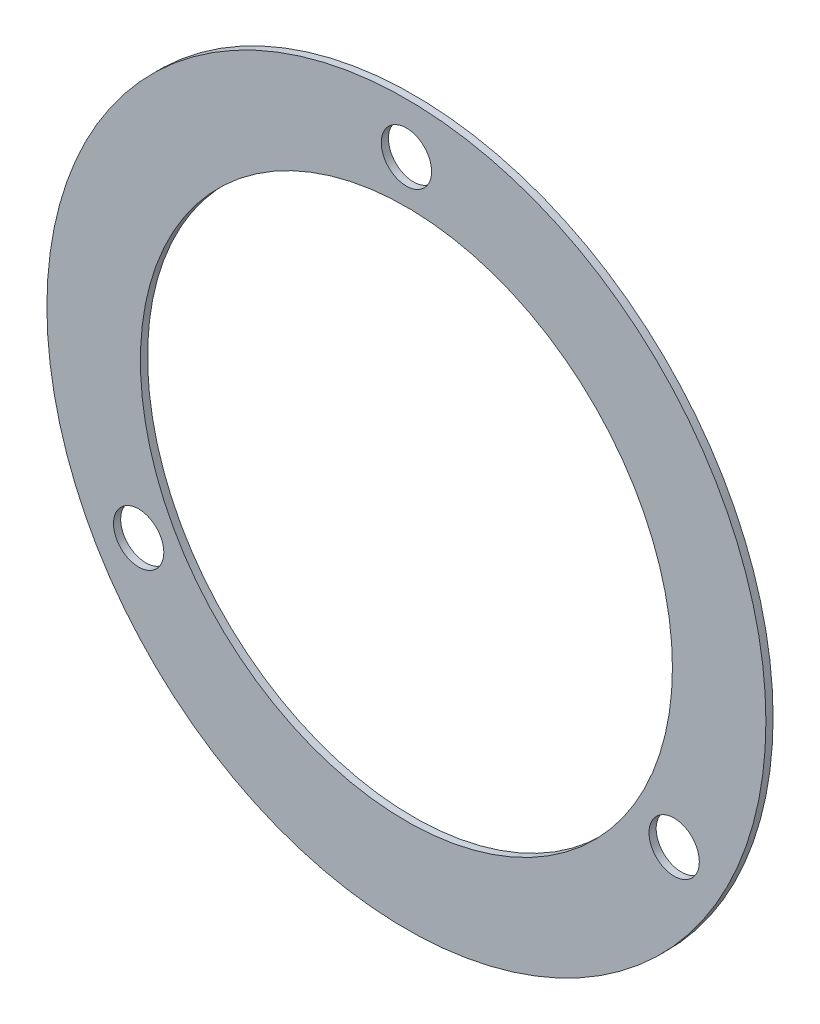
ISO-10303-21;
HEADER;
FILE_DESCRIPTION(('STEP AP214'),'2;1');
FILE_NAME('part.step','',(''),(''),'','','');
FILE_SCHEMA(('AUTOMOTIVE_DESIGN { 1 0 10303 214 1 1 1 1 }'));
ENDSEC;
DATA;
#1=APPLICATION_CONTEXT('core data for automotive mechanical design processes');
#2=APPLICATION_PROTOCOL_DEFINITION('international standard','automotive_design',2000,#1);
#3=PRODUCT_CONTEXT('',#1,'mechanical');
#4=PRODUCT('Part','Part','',(#3));
#5=PRODUCT_RELATED_PRODUCT_CATEGORY('part','',(#4));
#6=PRODUCT_DEFINITION_FORMATION('','',#4);
#7=PRODUCT_DEFINITION_CONTEXT('part definition',#1,'design');
#8=PRODUCT_DEFINITION('design','',#6,#7);
#9=PRODUCT_DEFINITION_SHAPE('','',#8);
#10=(LENGTH_UNIT() NAMED_UNIT(*) SI_UNIT(.MILLI.,.METRE.));
#11=(NAMED_UNIT(*) PLANE_ANGLE_UNIT() SI_UNIT($,.RADIAN.));
#12=(NAMED_UNIT(*) SI_UNIT($,.STERADIAN.) SOLID_ANGLE_UNIT());
#13=UNCERTAINTY_MEASURE_WITH_UNIT(LENGTH_MEASURE(1.E-05),#10,'distance_accuracy_value','');
#14=(GEOMETRIC_REPRESENTATION_CONTEXT(3) GLOBAL_UNCERTAINTY_ASSIGNED_CONTEXT((#13)) GLOBAL_UNIT_ASSIGNED_CONTEXT((#10,
#11,#12)) REPRESENTATION_CONTEXT('',''));
#15=CARTESIAN_POINT('',(0.,0.,0.));
#16=DIRECTION('',(0.,0.,1.));
#17=DIRECTION('',(1.,0.,0.));
#18=AXIS2_PLACEMENT_3D('',#15,#16,#17);
#19=CARTESIAN_POINT('',(0.,0.,1.));
#20=DIRECTION('',(0.,0.,1.));
#21=DIRECTION('',(1.,0.,0.));
#22=AXIS2_PLACEMENT_3D('',#19,#20,#21);
#23=PLANE('',#22);
#24=CARTESIAN_POINT('',(37.2390923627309,-21.4999999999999,1.));
#25=DIRECTION('',(0.,0.,1.));
#26=DIRECTION('',(1.,0.,0.));
#27=AXIS2_PLACEMENT_3D('',#24,#25,#26);
#28=CIRCLE('',#27,3.5);
#29=CARTESIAN_POINT('',(40.7390923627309,-21.4999999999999,1.));
#30=VERTEX_POINT('',#29);
#31=EDGE_CURVE('E59',#30,#30,#28,.T.);
#32=ORIENTED_EDGE('',*,*,#31,.F.);
#33=EDGE_LOOP('',(#32));
#34=FACE_BOUND('',#33,.T.);
#35=CARTESIAN_POINT('',(0.,0.,1.));
#36=DIRECTION('',(0.,0.,1.));
#37=DIRECTION('',(1.,0.,0.));
#38=AXIS2_PLACEMENT_3D('',#35,#36,#37);
#39=CIRCLE('',#38,37.);
#40=CARTESIAN_POINT('',(37.,0.,1.));
#41=VERTEX_POINT('',#40);
#42=EDGE_CURVE('E44',#41,#41,#39,.T.);
#43=ORIENTED_EDGE('',*,*,#42,.F.);
#44=EDGE_LOOP('',(#43));
#45=FACE_BOUND('',#44,.T.);
#46=CARTESIAN_POINT('',(0.,0.,1.));
#47=DIRECTION('',(0.,0.,1.));
#48=DIRECTION('',(1.,0.,0.));
#49=AXIS2_PLACEMENT_3D('',#46,#47,#48);
#50=CIRCLE('',#49,50.);
#51=CARTESIAN_POINT('',(50.,0.,1.));
#52=VERTEX_POINT('',#51);
#53=EDGE_CURVE('E10',#52,#52,#50,.T.);
#54=ORIENTED_EDGE('',*,*,#53,.T.);
#55=EDGE_LOOP('',(#54));
#56=FACE_BOUND('',#55,.T.);
#57=CARTESIAN_POINT('',(-37.2390923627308,-21.5000000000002,1.));
#58=DIRECTION('',(0.,0.,1.));
#59=DIRECTION('',(1.,0.,0.));
#60=AXIS2_PLACEMENT_3D('',#57,#58,#59);
#61=CIRCLE('',#60,3.5);
#62=CARTESIAN_POINT('',(-33.7390923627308,-21.5000000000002,1.));
#63=VERTEX_POINT('',#62);
#64=EDGE_CURVE('E53',#63,#63,#61,.T.);
#65=ORIENTED_EDGE('',*,*,#64,.F.);
#66=EDGE_LOOP('',(#65));
#67=FACE_BOUND('',#66,.T.);
#68=CARTESIAN_POINT('',(0.,43.,1.));
#69=DIRECTION('',(0.,0.,1.));
#70=DIRECTION('',(1.,0.,0.));
#71=AXIS2_PLACEMENT_3D('',#68,#69,#70);
#72=CIRCLE('',#71,3.5);
#73=CARTESIAN_POINT('',(3.5,43.,1.));
#74=VERTEX_POINT('',#73);
#75=EDGE_CURVE('E65',#74,#74,#72,.T.);
#76=ORIENTED_EDGE('',*,*,#75,.F.);
#77=EDGE_LOOP('',(#76));
#78=FACE_BOUND('',#77,.T.);
#79=ADVANCED_FACE('F33',(#34,#45,#56,#67,#78),#23,.T.);
#80=CARTESIAN_POINT('',(0.,0.,0.));
#81=DIRECTION('',(0.,0.,1.));
#82=DIRECTION('',(1.,0.,0.));
#83=AXIS2_PLACEMENT_3D('',#80,#81,#82);
#84=PLANE('',#83);
#85=CARTESIAN_POINT('',(37.2390923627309,-21.4999999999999,0.));
#86=DIRECTION('',(0.,0.,1.));
#87=DIRECTION('',(1.,0.,0.));
#88=AXIS2_PLACEMENT_3D('',#85,#86,#87);
#89=CIRCLE('',#88,3.5);
#90=CARTESIAN_POINT('',(40.7390923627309,-21.4999999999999,0.));
#91=VERTEX_POINT('',#90);
#92=EDGE_CURVE('E62',#91,#91,#89,.T.);
#93=ORIENTED_EDGE('',*,*,#92,.T.);
#94=EDGE_LOOP('',(#93));
#95=FACE_BOUND('',#94,.T.);
#96=CARTESIAN_POINT('',(0.,0.,0.));
#97=DIRECTION('',(0.,0.,1.));
#98=DIRECTION('',(1.,0.,0.));
#99=AXIS2_PLACEMENT_3D('',#96,#97,#98);
#100=CIRCLE('',#99,37.);
#101=CARTESIAN_POINT('',(37.,0.,0.));
#102=VERTEX_POINT('',#101);
#103=EDGE_CURVE('E48',#102,#102,#100,.T.);
#104=ORIENTED_EDGE('',*,*,#103,.T.);
#105=EDGE_LOOP('',(#104));
#106=FACE_BOUND('',#105,.T.);
#107=CARTESIAN_POINT('',(0.,0.,0.));
#108=DIRECTION('',(0.,0.,1.));
#109=DIRECTION('',(1.,0.,0.));
#110=AXIS2_PLACEMENT_3D('',#107,#108,#109);
#111=CIRCLE('',#110,50.);
#112=CARTESIAN_POINT('',(50.,0.,0.));
#113=VERTEX_POINT('',#112);
#114=EDGE_CURVE('E40',#113,#113,#111,.T.);
#115=ORIENTED_EDGE('',*,*,#114,.F.);
#116=EDGE_LOOP('',(#115));
#117=FACE_BOUND('',#116,.T.);
#118=CARTESIAN_POINT('',(-37.2390923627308,-21.5000000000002,0.));
#119=DIRECTION('',(0.,0.,1.));
#120=DIRECTION('',(1.,0.,0.));
#121=AXIS2_PLACEMENT_3D('',#118,#119,#120);
#122=CIRCLE('',#121,3.5);
#123=CARTESIAN_POINT('',(-33.7390923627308,-21.5000000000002,0.));
#124=VERTEX_POINT('',#123);
#125=EDGE_CURVE('E56',#124,#124,#122,.T.);
#126=ORIENTED_EDGE('',*,*,#125,.T.);
#127=EDGE_LOOP('',(#126));
#128=FACE_BOUND('',#127,.T.);
#129=CARTESIAN_POINT('',(0.,43.,0.));
#130=DIRECTION('',(0.,0.,1.));
#131=DIRECTION('',(1.,0.,0.));
#132=AXIS2_PLACEMENT_3D('',#129,#130,#131);
#133=CIRCLE('',#132,3.5);
#134=CARTESIAN_POINT('',(3.5,43.,0.));
#135=VERTEX_POINT('',#134);
#136=EDGE_CURVE('E68',#135,#135,#133,.T.);
#137=ORIENTED_EDGE('',*,*,#136,.T.);
#138=EDGE_LOOP('',(#137));
#139=FACE_BOUND('',#138,.T.);
#140=ADVANCED_FACE('F72',(#95,#106,#117,#128,#139),#84,.F.);
#141=CARTESIAN_POINT('',(0.,0.,1.));
#142=DIRECTION('',(0.,0.,-1.));
#143=DIRECTION('',(-1.,0.,0.));
#144=AXIS2_PLACEMENT_3D('',#141,#142,#143);
#145=CYLINDRICAL_SURFACE('',#144,50.);
#146=ORIENTED_EDGE('',*,*,#53,.F.);
#147=EDGE_LOOP('',(#146));
#148=FACE_BOUND('',#147,.T.);
#149=ORIENTED_EDGE('',*,*,#114,.T.);
#150=EDGE_LOOP('',(#149));
#151=FACE_BOUND('',#150,.T.);
#152=ADVANCED_FACE('F35',(#148,#151),#145,.T.);
#153=CARTESIAN_POINT('',(0.,0.,1.));
#154=DIRECTION('',(0.,0.,-1.));
#155=DIRECTION('',(-1.,0.,0.));
#156=AXIS2_PLACEMENT_3D('',#153,#154,#155);
#157=CYLINDRICAL_SURFACE('',#156,37.);
#158=ORIENTED_EDGE('',*,*,#42,.T.);
#159=EDGE_LOOP('',(#158));
#160=FACE_BOUND('',#159,.T.);
#161=ORIENTED_EDGE('',*,*,#103,.F.);
#162=EDGE_LOOP('',(#161));
#163=FACE_BOUND('',#162,.T.);
#164=ADVANCED_FACE('F95',(#160,#163),#157,.F.);
#165=CARTESIAN_POINT('',(-37.2390923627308,-21.5000000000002,1.));
#166=DIRECTION('',(0.,0.,-1.));
#167=DIRECTION('',(-1.,0.,0.));
#168=AXIS2_PLACEMENT_3D('',#165,#166,#167);
#169=CYLINDRICAL_SURFACE('',#168,3.5);
#170=ORIENTED_EDGE('',*,*,#64,.T.);
#171=EDGE_LOOP('',(#170));
#172=FACE_BOUND('',#171,.T.);
#173=ORIENTED_EDGE('',*,*,#125,.F.);
#174=EDGE_LOOP('',(#173));
#175=FACE_BOUND('',#174,.T.);
#176=ADVANCED_FACE('F82',(#172,#175),#169,.F.);
#177=CARTESIAN_POINT('',(37.2390923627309,-21.4999999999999,1.));
#178=DIRECTION('',(0.,0.,-1.));
#179=DIRECTION('',(-1.,0.,0.));
#180=AXIS2_PLACEMENT_3D('',#177,#178,#179);
#181=CYLINDRICAL_SURFACE('',#180,3.5);
#182=ORIENTED_EDGE('',*,*,#31,.T.);
#183=EDGE_LOOP('',(#182));
#184=FACE_BOUND('',#183,.T.);
#185=ORIENTED_EDGE('',*,*,#92,.F.);
#186=EDGE_LOOP('',(#185));
#187=FACE_BOUND('',#186,.T.);
#188=ADVANCED_FACE('F76',(#184,#187),#181,.F.);
#189=CARTESIAN_POINT('',(0.,43.,1.));
#190=DIRECTION('',(0.,0.,-1.));
#191=DIRECTION('',(-1.,0.,0.));
#192=AXIS2_PLACEMENT_3D('',#189,#190,#191);
#193=CYLINDRICAL_SURFACE('',#192,3.5);
#194=ORIENTED_EDGE('',*,*,#75,.T.);
#195=EDGE_LOOP('',(#194));
#196=FACE_BOUND('',#195,.T.);
#197=ORIENTED_EDGE('',*,*,#136,.F.);
#198=EDGE_LOOP('',(#197));
#199=FACE_BOUND('',#198,.T.);
#200=ADVANCED_FACE('F74',(#196,#199),#193,.F.);
#201=CLOSED_SHELL('',(#79,#140,#152,#164,#176,#188,#200));
#202=MANIFOLD_SOLID_BREP('B2',#201);
#203=ADVANCED_BREP_SHAPE_REPRESENTATION('',(#18,#202),#14);
#204=SHAPE_DEFINITION_REPRESENTATION(#9,#203);
ENDSEC;
END-ISO-10303-21;
